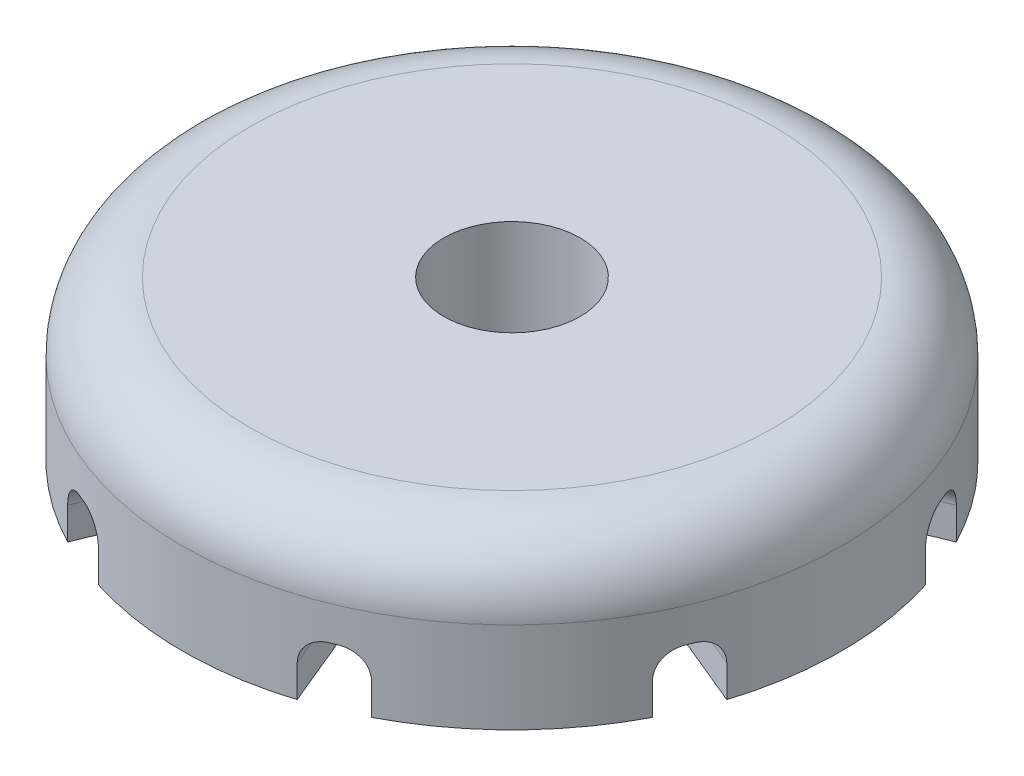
from build123d import *

# Parameters (mm, degrees)
GEH_USE_R                       = 14.5
AUFSATZ_LINEAR_AUSTRAGEN3_DEPTH = 7
SOCKEL_W                        = 7
SOCKEL_H                        = 7
AUFSATZ_LINEAR_AUSTRAGEN4_DEPTH = 1.5
SCHNITT_LINEAR_AUSTRAGEN1_DEPTH = 2.5
VERRUNDUNG1_R                   = 1.1
VERRUNDUNG2_R                   = 3
SKIZZE5_R                       = 3
SCHNITT_LINEAR_AUSTRAGEN2_DEPTH = 23.197973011


with BuildPart() as part:
    # Geh_use → Aufsatz-Linear austragen3 (new body)
    with BuildSketch(Plane(origin=(0, 0, 0), x_dir=(1, 0, 0), z_dir=(0, 1, 0))):
        with Locations(Location((0, 0, 0), (0, 0, 270))):
            Circle(GEH_USE_R)
    extrude(amount=AUFSATZ_LINEAR_AUSTRAGEN3_DEPTH)

    # Sockel → Aufsatz-Linear austragen4 (add)
    with BuildSketch(Plane(origin=(0, 0, 0), x_dir=(-1, 0, 0), z_dir=(0, -1, 0))):
        Rectangle(SOCKEL_W, SOCKEL_H)
    extrude(amount=AUFSATZ_LINEAR_AUSTRAGEN4_DEPTH)

    # Skizze4 → Schnitt-Linear austragen1 (cut)
    with BuildSketch(Plane.XZ):
        with BuildLine():
            Line((5.988802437, 3.833633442), (12.917898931, 6.703759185))
            ThreePointArc((12.917898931, 6.703759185), (14.551102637, 6.02726406), (13.874607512, 4.394060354))
            Line((13.874607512, 4.394060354), (6.945511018, 1.523934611))
            ThreePointArc((6.945511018, 1.523934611), (5.312307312, 2.200429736), (5.988802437, 3.833633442))
        make_face()
        with BuildLine():
            Line((6.945511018, -1.523934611), (13.874607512, -4.394060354))
            ThreePointArc((13.874607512, -4.394060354), (14.551102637, -6.02726406), (12.917898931, -6.703759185))
            Line((12.917898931, -6.703759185), (5.988802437, -3.833633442))
            ThreePointArc((5.988802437, -3.833633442), (5.312307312, -2.200429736), (6.945511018, -1.523934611))
        make_face()
        with BuildLine():
            Line((3.833633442, -5.988802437), (6.703759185, -12.917898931))
            ThreePointArc((6.703759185, -12.917898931), (6.02726406, -14.551102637), (4.394060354, -13.874607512))
            Line((4.394060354, -13.874607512), (1.523934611, -6.945511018))
            ThreePointArc((1.523934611, -6.945511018), (2.200429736, -5.312307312), (3.833633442, -5.988802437))
        make_face()
        with BuildLine():
            Line((-1.523934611, -6.945511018), (-4.394060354, -13.874607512))
            ThreePointArc((-4.394060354, -13.874607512), (-6.02726406, -14.551102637), (-6.703759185, -12.917898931))
            Line((-6.703759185, -12.917898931), (-3.833633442, -5.988802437))
            ThreePointArc((-3.833633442, -5.988802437), (-2.200429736, -5.312307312), (-1.523934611, -6.945511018))
        make_face()
        with BuildLine():
            Line((-5.988802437, -3.833633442), (-12.917898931, -6.703759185))
            ThreePointArc((-12.917898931, -6.703759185), (-14.551102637, -6.02726406), (-13.874607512, -4.394060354))
            Line((-13.874607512, -4.394060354), (-6.945511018, -1.523934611))
            ThreePointArc((-6.945511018, -1.523934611), (-5.312307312, -2.200429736), (-5.988802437, -3.833633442))
        make_face()
        with BuildLine():
            Line((-6.945511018, 1.523934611), (-13.874607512, 4.394060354))
            ThreePointArc((-13.874607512, 4.394060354), (-14.551102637, 6.02726406), (-12.917898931, 6.703759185))
            Line((-12.917898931, 6.703759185), (-5.988802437, 3.833633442))
            ThreePointArc((-5.988802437, 3.833633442), (-5.312307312, 2.200429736), (-6.945511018, 1.523934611))
        make_face()
        with BuildLine():
            Line((-3.833633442, 5.988802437), (-6.703759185, 12.917898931))
            ThreePointArc((-6.703759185, 12.917898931), (-6.02726406, 14.551102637), (-4.394060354, 13.874607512))
            Line((-4.394060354, 13.874607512), (-1.523934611, 6.945511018))
            ThreePointArc((-1.523934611, 6.945511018), (-2.200429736, 5.312307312), (-3.833633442, 5.988802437))
        make_face()
        with BuildLine():
            Line((1.523934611, 6.945511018), (4.394060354, 13.874607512))
            ThreePointArc((4.394060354, 13.874607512), (6.02726406, 14.551102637), (6.703759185, 12.917898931))
            Line((6.703759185, 12.917898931), (3.833633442, 5.988802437))
            ThreePointArc((3.833633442, 5.988802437), (2.200429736, 5.312307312), (1.523934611, 6.945511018))
        make_face()
    extrude(amount=-SCHNITT_LINEAR_AUSTRAGEN1_DEPTH, mode=Mode.SUBTRACT)

    # Verrundung1
    verrundung1_edges = [part.edges().sort_by_distance(p)[0] for p in [
        (-10.385123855, 2.5, 2.948668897),
        (-9.428415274, 2.5, 5.258367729),
        (-5.312307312, 2.5, 2.200429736),
        (-5.258367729, 2.5, 9.428415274),
        (-2.948668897, 2.5, 10.385123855),
        (-2.200429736, 2.5, 5.312307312),
        (2.948668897, 2.5, 10.385123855),
        (5.258367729, 2.5, 9.428415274),
        (2.200429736, 2.5, 5.312307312),
        (9.428415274, 2.5, 5.258367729),
        (10.385123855, 2.5, 2.948668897),
        (5.312307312, 2.5, 2.200429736),
        (10.385123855, 2.5, -2.948668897),
        (9.428415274, 2.5, -5.258367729),
        (5.312307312, 2.5, -2.200429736),
        (5.258367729, 2.5, -9.428415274),
        (2.948668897, 2.5, -10.385123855),
        (2.200429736, 2.5, -5.312307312),
        (-2.948668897, 2.5, -10.385123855),
        (-5.258367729, 2.5, -9.428415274),
        (-2.200429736, 2.5, -5.312307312),
        (-9.428415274, 2.5, -5.258367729),
        (-10.385123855, 2.5, -2.948668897),
        (-5.312307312, 2.5, -2.200429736),
    ]]
    fillet(verrundung1_edges, radius=VERRUNDUNG1_R)

    # Verrundung2
    verrundung2_edges = [part.edges().sort_by_distance(p)[0] for p in [
        (0, 7, -14.5),
    ]]
    fillet(verrundung2_edges, radius=VERRUNDUNG2_R)

    # Skizze5 → Schnitt-Linear austragen2 (cut, through all)
    with BuildSketch(Plane(origin=(0, -1.5, 0), x_dir=(-1, 0, 0), z_dir=(0, -1, 0))):
        with Locations(Location((0, 0, 0), (0, 0, 90))):
            Circle(SKIZZE5_R)
    extrude(amount=-SCHNITT_LINEAR_AUSTRAGEN2_DEPTH, mode=Mode.SUBTRACT)


solid = part.part
